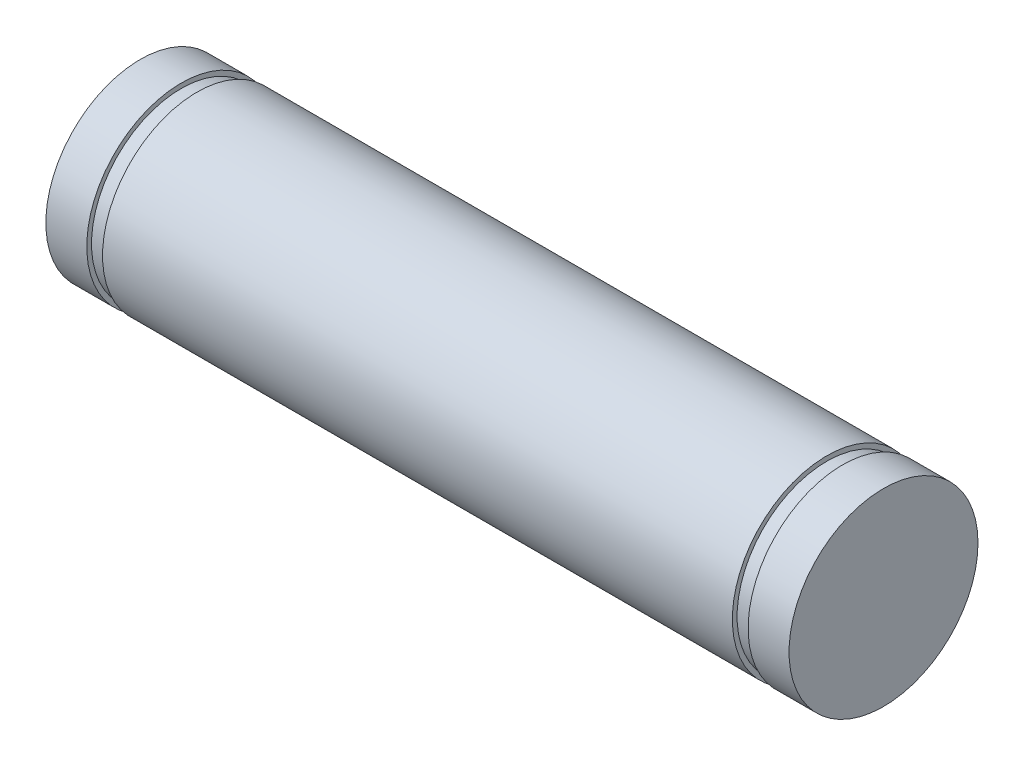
ISO-10303-21;
HEADER;
FILE_DESCRIPTION(('STEP AP214'),'2;1');
FILE_NAME('part.step','',(''),(''),'','','');
FILE_SCHEMA(('AUTOMOTIVE_DESIGN { 1 0 10303 214 1 1 1 1 }'));
ENDSEC;
DATA;
#1=APPLICATION_CONTEXT('core data for automotive mechanical design processes');
#2=APPLICATION_PROTOCOL_DEFINITION('international standard','automotive_design',2000,#1);
#3=PRODUCT_CONTEXT('',#1,'mechanical');
#4=PRODUCT('Part','Part','',(#3));
#5=PRODUCT_RELATED_PRODUCT_CATEGORY('part','',(#4));
#6=PRODUCT_DEFINITION_FORMATION('','',#4);
#7=PRODUCT_DEFINITION_CONTEXT('part definition',#1,'design');
#8=PRODUCT_DEFINITION('design','',#6,#7);
#9=PRODUCT_DEFINITION_SHAPE('','',#8);
#10=(LENGTH_UNIT() NAMED_UNIT(*) SI_UNIT(.MILLI.,.METRE.));
#11=(NAMED_UNIT(*) PLANE_ANGLE_UNIT() SI_UNIT($,.RADIAN.));
#12=(NAMED_UNIT(*) SI_UNIT($,.STERADIAN.) SOLID_ANGLE_UNIT());
#13=UNCERTAINTY_MEASURE_WITH_UNIT(LENGTH_MEASURE(1.E-05),#10,'distance_accuracy_value','');
#14=(GEOMETRIC_REPRESENTATION_CONTEXT(3) GLOBAL_UNCERTAINTY_ASSIGNED_CONTEXT((#13)) GLOBAL_UNIT_ASSIGNED_CONTEXT((#10,
#11,#12)) REPRESENTATION_CONTEXT('',''));
#15=CARTESIAN_POINT('',(0.,0.,0.));
#16=DIRECTION('',(0.,0.,1.));
#17=DIRECTION('',(1.,0.,0.));
#18=AXIS2_PLACEMENT_3D('',#15,#16,#17);
#19=CARTESIAN_POINT('',(-11.8,0.,0.));
#20=DIRECTION('',(-1.,0.,0.));
#21=DIRECTION('',(0.,0.,1.));
#22=AXIS2_PLACEMENT_3D('',#19,#20,#21);
#23=PLANE('',#22);
#24=CARTESIAN_POINT('',(-11.8,0.,0.));
#25=DIRECTION('',(1.,0.,0.));
#26=DIRECTION('',(0.,0.,-1.));
#27=AXIS2_PLACEMENT_3D('',#24,#25,#26);
#28=CIRCLE('',#27,3.);
#29=CARTESIAN_POINT('',(-11.8,0.,-3.));
#30=VERTEX_POINT('',#29);
#31=EDGE_CURVE('E10',#30,#30,#28,.T.);
#32=ORIENTED_EDGE('',*,*,#31,.F.);
#33=EDGE_LOOP('',(#32));
#34=FACE_BOUND('',#33,.T.);
#35=ADVANCED_FACE('F33',(#34),#23,.T.);
#36=CARTESIAN_POINT('',(11.8,0.,0.));
#37=DIRECTION('',(1.,0.,0.));
#38=DIRECTION('',(0.,0.,-1.));
#39=AXIS2_PLACEMENT_3D('',#36,#37,#38);
#40=CYLINDRICAL_SURFACE('',#39,3.);
#41=ORIENTED_EDGE('',*,*,#31,.T.);
#42=EDGE_LOOP('',(#41));
#43=FACE_BOUND('',#42,.T.);
#44=CARTESIAN_POINT('',(-10.5,0.,0.));
#45=DIRECTION('',(1.,0.,0.));
#46=DIRECTION('',(0.,0.,-1.));
#47=AXIS2_PLACEMENT_3D('',#44,#45,#46);
#48=CIRCLE('',#47,3.);
#49=CARTESIAN_POINT('',(-10.5,0.,-3.));
#50=VERTEX_POINT('',#49);
#51=EDGE_CURVE('E39',#50,#50,#48,.T.);
#52=ORIENTED_EDGE('',*,*,#51,.F.);
#53=EDGE_LOOP('',(#52));
#54=FACE_BOUND('',#53,.T.);
#55=ADVANCED_FACE('F87',(#43,#54),#40,.T.);
#56=CARTESIAN_POINT('',(-10.5,0.,-3.));
#57=DIRECTION('',(1.,0.,0.));
#58=DIRECTION('',(0.,0.,-1.));
#59=AXIS2_PLACEMENT_3D('',#56,#57,#58);
#60=PLANE('',#59);
#61=ORIENTED_EDGE('',*,*,#51,.T.);
#62=EDGE_LOOP('',(#61));
#63=FACE_BOUND('',#62,.T.);
#64=CARTESIAN_POINT('',(-10.5,0.,0.));
#65=DIRECTION('',(1.,0.,0.));
#66=DIRECTION('',(0.,0.,-1.));
#67=AXIS2_PLACEMENT_3D('',#64,#65,#66);
#68=CIRCLE('',#67,2.85);
#69=CARTESIAN_POINT('',(-10.5,0.,-2.85));
#70=VERTEX_POINT('',#69);
#71=EDGE_CURVE('E43',#70,#70,#68,.T.);
#72=ORIENTED_EDGE('',*,*,#71,.F.);
#73=EDGE_LOOP('',(#72));
#74=FACE_BOUND('',#73,.T.);
#75=ADVANCED_FACE('F92',(#63,#74),#60,.T.);
#76=CARTESIAN_POINT('',(11.8,0.,0.));
#77=DIRECTION('',(1.,0.,0.));
#78=DIRECTION('',(0.,0.,-1.));
#79=AXIS2_PLACEMENT_3D('',#76,#77,#78);
#80=CYLINDRICAL_SURFACE('',#79,2.85);
#81=ORIENTED_EDGE('',*,*,#71,.T.);
#82=EDGE_LOOP('',(#81));
#83=FACE_BOUND('',#82,.T.);
#84=CARTESIAN_POINT('',(-10.,0.,0.));
#85=DIRECTION('',(1.,0.,0.));
#86=DIRECTION('',(0.,0.,-1.));
#87=AXIS2_PLACEMENT_3D('',#84,#85,#86);
#88=CIRCLE('',#87,2.85);
#89=CARTESIAN_POINT('',(-10.,0.,-2.85));
#90=VERTEX_POINT('',#89);
#91=EDGE_CURVE('E47',#90,#90,#88,.T.);
#92=ORIENTED_EDGE('',*,*,#91,.F.);
#93=EDGE_LOOP('',(#92));
#94=FACE_BOUND('',#93,.T.);
#95=ADVANCED_FACE('F96',(#83,#94),#80,.T.);
#96=CARTESIAN_POINT('',(-10.,0.,-2.85));
#97=DIRECTION('',(-1.,0.,0.));
#98=DIRECTION('',(0.,0.,1.));
#99=AXIS2_PLACEMENT_3D('',#96,#97,#98);
#100=PLANE('',#99);
#101=ORIENTED_EDGE('',*,*,#91,.T.);
#102=EDGE_LOOP('',(#101));
#103=FACE_BOUND('',#102,.T.);
#104=CARTESIAN_POINT('',(-10.,0.,0.));
#105=DIRECTION('',(1.,0.,0.));
#106=DIRECTION('',(0.,0.,-1.));
#107=AXIS2_PLACEMENT_3D('',#104,#105,#106);
#108=CIRCLE('',#107,3.);
#109=CARTESIAN_POINT('',(-10.,0.,-3.));
#110=VERTEX_POINT('',#109);
#111=EDGE_CURVE('E52',#110,#110,#108,.T.);
#112=ORIENTED_EDGE('',*,*,#111,.F.);
#113=EDGE_LOOP('',(#112));
#114=FACE_BOUND('',#113,.T.);
#115=ADVANCED_FACE('F102',(#103,#114),#100,.T.);
#116=CARTESIAN_POINT('',(11.8,0.,0.));
#117=DIRECTION('',(1.,0.,0.));
#118=DIRECTION('',(0.,0.,-1.));
#119=AXIS2_PLACEMENT_3D('',#116,#117,#118);
#120=CYLINDRICAL_SURFACE('',#119,3.);
#121=ORIENTED_EDGE('',*,*,#111,.T.);
#122=EDGE_LOOP('',(#121));
#123=FACE_BOUND('',#122,.T.);
#124=CARTESIAN_POINT('',(10.,0.,0.));
#125=DIRECTION('',(1.,0.,0.));
#126=DIRECTION('',(0.,0.,-1.));
#127=AXIS2_PLACEMENT_3D('',#124,#125,#126);
#128=CIRCLE('',#127,3.);
#129=CARTESIAN_POINT('',(10.,0.,-3.));
#130=VERTEX_POINT('',#129);
#131=EDGE_CURVE('E55',#130,#130,#128,.T.);
#132=ORIENTED_EDGE('',*,*,#131,.F.);
#133=EDGE_LOOP('',(#132));
#134=FACE_BOUND('',#133,.T.);
#135=ADVANCED_FACE('F106',(#123,#134),#120,.T.);
#136=CARTESIAN_POINT('',(10.,0.,-2.85));
#137=DIRECTION('',(1.,0.,0.));
#138=DIRECTION('',(0.,0.,-1.));
#139=AXIS2_PLACEMENT_3D('',#136,#137,#138);
#140=PLANE('',#139);
#141=ORIENTED_EDGE('',*,*,#131,.T.);
#142=EDGE_LOOP('',(#141));
#143=FACE_BOUND('',#142,.T.);
#144=CARTESIAN_POINT('',(10.,0.,0.));
#145=DIRECTION('',(1.,0.,0.));
#146=DIRECTION('',(0.,0.,-1.));
#147=AXIS2_PLACEMENT_3D('',#144,#145,#146);
#148=CIRCLE('',#147,2.85);
#149=CARTESIAN_POINT('',(10.,0.,-2.85));
#150=VERTEX_POINT('',#149);
#151=EDGE_CURVE('E58',#150,#150,#148,.T.);
#152=ORIENTED_EDGE('',*,*,#151,.F.);
#153=EDGE_LOOP('',(#152));
#154=FACE_BOUND('',#153,.T.);
#155=ADVANCED_FACE('F110',(#143,#154),#140,.T.);
#156=CARTESIAN_POINT('',(11.8,0.,0.));
#157=DIRECTION('',(1.,0.,0.));
#158=DIRECTION('',(0.,0.,-1.));
#159=AXIS2_PLACEMENT_3D('',#156,#157,#158);
#160=CYLINDRICAL_SURFACE('',#159,2.85);
#161=ORIENTED_EDGE('',*,*,#151,.T.);
#162=EDGE_LOOP('',(#161));
#163=FACE_BOUND('',#162,.T.);
#164=CARTESIAN_POINT('',(10.5,0.,0.));
#165=DIRECTION('',(1.,0.,0.));
#166=DIRECTION('',(0.,0.,-1.));
#167=AXIS2_PLACEMENT_3D('',#164,#165,#166);
#168=CIRCLE('',#167,2.85);
#169=CARTESIAN_POINT('',(10.5,0.,-2.85));
#170=VERTEX_POINT('',#169);
#171=EDGE_CURVE('E61',#170,#170,#168,.T.);
#172=ORIENTED_EDGE('',*,*,#171,.F.);
#173=EDGE_LOOP('',(#172));
#174=FACE_BOUND('',#173,.T.);
#175=ADVANCED_FACE('F83',(#163,#174),#160,.T.);
#176=CARTESIAN_POINT('',(10.5,0.,-3.));
#177=DIRECTION('',(-1.,0.,0.));
#178=DIRECTION('',(0.,0.,1.));
#179=AXIS2_PLACEMENT_3D('',#176,#177,#178);
#180=PLANE('',#179);
#181=ORIENTED_EDGE('',*,*,#171,.T.);
#182=EDGE_LOOP('',(#181));
#183=FACE_BOUND('',#182,.T.);
#184=CARTESIAN_POINT('',(10.5,0.,0.));
#185=DIRECTION('',(1.,0.,0.));
#186=DIRECTION('',(0.,0.,-1.));
#187=AXIS2_PLACEMENT_3D('',#184,#185,#186);
#188=CIRCLE('',#187,3.);
#189=CARTESIAN_POINT('',(10.5,0.,-3.));
#190=VERTEX_POINT('',#189);
#191=EDGE_CURVE('E64',#190,#190,#188,.T.);
#192=ORIENTED_EDGE('',*,*,#191,.F.);
#193=EDGE_LOOP('',(#192));
#194=FACE_BOUND('',#193,.T.);
#195=ADVANCED_FACE('F75',(#183,#194),#180,.T.);
#196=CARTESIAN_POINT('',(11.8,0.,0.));
#197=DIRECTION('',(1.,0.,0.));
#198=DIRECTION('',(0.,0.,-1.));
#199=AXIS2_PLACEMENT_3D('',#196,#197,#198);
#200=CYLINDRICAL_SURFACE('',#199,3.);
#201=ORIENTED_EDGE('',*,*,#191,.T.);
#202=EDGE_LOOP('',(#201));
#203=FACE_BOUND('',#202,.T.);
#204=CARTESIAN_POINT('',(11.8,0.,0.));
#205=DIRECTION('',(1.,0.,0.));
#206=DIRECTION('',(0.,0.,-1.));
#207=AXIS2_PLACEMENT_3D('',#204,#205,#206);
#208=CIRCLE('',#207,3.);
#209=CARTESIAN_POINT('',(11.8,0.,-3.));
#210=VERTEX_POINT('',#209);
#211=EDGE_CURVE('E67',#210,#210,#208,.T.);
#212=ORIENTED_EDGE('',*,*,#211,.F.);
#213=EDGE_LOOP('',(#212));
#214=FACE_BOUND('',#213,.T.);
#215=ADVANCED_FACE('F73',(#203,#214),#200,.T.);
#216=CARTESIAN_POINT('',(11.8,0.,0.));
#217=DIRECTION('',(1.,0.,0.));
#218=DIRECTION('',(0.,0.,-1.));
#219=AXIS2_PLACEMENT_3D('',#216,#217,#218);
#220=PLANE('',#219);
#221=ORIENTED_EDGE('',*,*,#211,.T.);
#222=EDGE_LOOP('',(#221));
#223=FACE_BOUND('',#222,.T.);
#224=ADVANCED_FACE('F71',(#223),#220,.T.);
#225=CLOSED_SHELL('',(#35,#55,#75,#95,#115,#135,#155,#175,#195,#215,#224));
#226=MANIFOLD_SOLID_BREP('B2',#225);
#227=ADVANCED_BREP_SHAPE_REPRESENTATION('',(#18,#226),#14);
#228=SHAPE_DEFINITION_REPRESENTATION(#9,#227);
ENDSEC;
END-ISO-10303-21;
